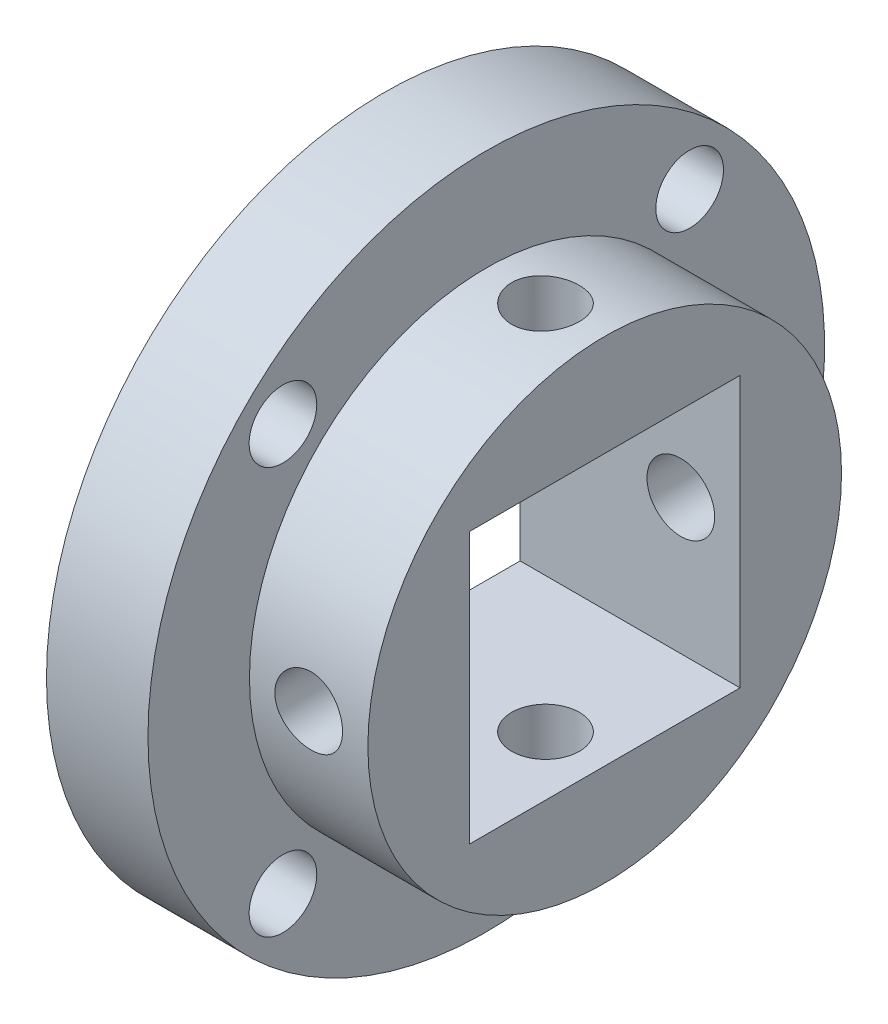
from build123d import *

# Parameters (mm, degrees)
ESQUISSE2_R                  = 2
ESQUISSE2_W                  = 16
ESQUISSE2_H                  = 16
ENL_V_MAT_EXTRU_1_DEPTH      = 32.128764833
ESQUISSE3_R                  = 2
ENL_V_MAT_EXTRU_2_DEPTH      = 32.128764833
R_P_TITION_CIRCULAIRE1_COUNT = 4


with BuildPart() as part:
    # Esquisse1 → R_volution1 (revolve)
    with BuildSketch(Plane.XY, mode=Mode.PRIVATE) as r_volution1_sk:
        Polygon((0, 0), (13, 0), (13, 14), (6, 14), (6, 20), (0, 20), align=None)
    revolve(r_volution1_sk.sketch.rotate(Axis((-19.097215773, 0, 0), (1, 0, 0)), 90), axis=Axis((-19.097215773, 0, 0), (1, 0, 0)))

    # Esquisse2 → Enl_v. mat.-Extru.1 (cut, through all)
    with BuildSketch(Plane(origin=(13, 0, 0), x_dir=(0, 0, -1), z_dir=(1, 0, 0))):
        with Locations((-12.02081528, 12.02081528)):
            Circle(ESQUISSE2_R)
        with Locations((12.02081528, 12.02081528)):
            Circle(ESQUISSE2_R)
        with Locations((12.02081528, -12.02081528)):
            Circle(ESQUISSE2_R)
        with Locations((-12.02081528, -12.02081528)):
            Circle(ESQUISSE2_R)
        Rectangle(ESQUISSE2_W, ESQUISSE2_H)
    extrude(amount=-ENL_V_MAT_EXTRU_1_DEPTH, mode=Mode.SUBTRACT)

    # Esquisse3 → Enl_v. mat.-Extru.2 (cut, through all)
    with BuildSketch(Plane(origin=(0, 0, 0), x_dir=(1, 0, 0), z_dir=(0, 1, 0))):
        with Locations(Location((9.5, 0, 0), (0, 0, 270))):
            Circle(ESQUISSE3_R)
    enl_v_mat_extru_2 = extrude(amount=-ENL_V_MAT_EXTRU_2_DEPTH, mode=Mode.SUBTRACT)

    # R_p_tition circulaire1: Enl_v. mat.-Extru.2 ×4 about axis
    r_p_tition_circulaire1_axis = Axis((-19.097215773, 0, 0), (-1, 0, 0))
    for i in range(1, R_P_TITION_CIRCULAIRE1_COUNT):
        add(enl_v_mat_extru_2.rotate(r_p_tition_circulaire1_axis, i * 360 / R_P_TITION_CIRCULAIRE1_COUNT), mode=Mode.SUBTRACT)


solid = part.part
